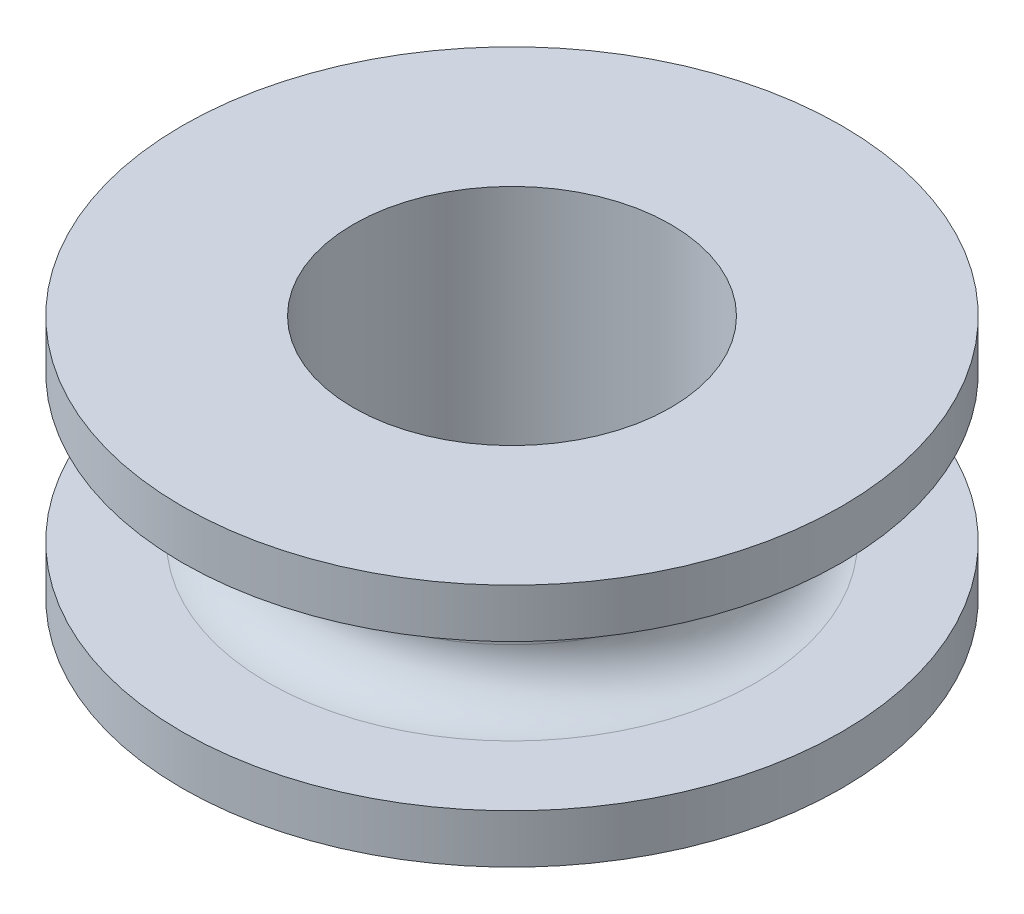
ISO-10303-21;
HEADER;
FILE_DESCRIPTION(('STEP AP214'),'2;1');
FILE_NAME('part.step','',(''),(''),'','','');
FILE_SCHEMA(('AUTOMOTIVE_DESIGN { 1 0 10303 214 1 1 1 1 }'));
ENDSEC;
DATA;
#1=APPLICATION_CONTEXT('core data for automotive mechanical design processes');
#2=APPLICATION_PROTOCOL_DEFINITION('international standard','automotive_design',2000,#1);
#3=PRODUCT_CONTEXT('',#1,'mechanical');
#4=PRODUCT('Part','Part','',(#3));
#5=PRODUCT_RELATED_PRODUCT_CATEGORY('part','',(#4));
#6=PRODUCT_DEFINITION_FORMATION('','',#4);
#7=PRODUCT_DEFINITION_CONTEXT('part definition',#1,'design');
#8=PRODUCT_DEFINITION('design','',#6,#7);
#9=PRODUCT_DEFINITION_SHAPE('','',#8);
#10=(LENGTH_UNIT() NAMED_UNIT(*) SI_UNIT(.MILLI.,.METRE.));
#11=(NAMED_UNIT(*) PLANE_ANGLE_UNIT() SI_UNIT($,.RADIAN.));
#12=(NAMED_UNIT(*) SI_UNIT($,.STERADIAN.) SOLID_ANGLE_UNIT());
#13=UNCERTAINTY_MEASURE_WITH_UNIT(LENGTH_MEASURE(1.E-05),#10,'distance_accuracy_value','');
#14=(GEOMETRIC_REPRESENTATION_CONTEXT(3) GLOBAL_UNCERTAINTY_ASSIGNED_CONTEXT((#13)) GLOBAL_UNIT_ASSIGNED_CONTEXT((#10,
#11,#12)) REPRESENTATION_CONTEXT('',''));
#15=CARTESIAN_POINT('',(0.,0.,0.));
#16=DIRECTION('',(0.,0.,1.));
#17=DIRECTION('',(1.,0.,0.));
#18=AXIS2_PLACEMENT_3D('',#15,#16,#17);
#19=CARTESIAN_POINT('',(0.,10.,0.));
#20=DIRECTION('',(0.,-1.,0.));
#21=DIRECTION('',(0.,0.,-1.));
#22=AXIS2_PLACEMENT_3D('',#19,#20,#21);
#23=CYLINDRICAL_SURFACE('',#22,8.);
#24=CARTESIAN_POINT('',(0.,6.,0.));
#25=DIRECTION('',(0.,1.,0.));
#26=DIRECTION('',(0.,0.,1.));
#27=AXIS2_PLACEMENT_3D('',#24,#25,#26);
#28=CIRCLE('',#27,8.);
#29=CARTESIAN_POINT('',(0.,6.,8.));
#30=VERTEX_POINT('',#29);
#31=EDGE_CURVE('E40',#30,#30,#28,.F.);
#32=ORIENTED_EDGE('',*,*,#31,.T.);
#33=EDGE_LOOP('',(#32));
#34=FACE_BOUND('',#33,.T.);
#35=CARTESIAN_POINT('',(0.,4.,0.));
#36=DIRECTION('',(0.,-1.,0.));
#37=DIRECTION('',(0.,0.,-1.));
#38=AXIS2_PLACEMENT_3D('',#35,#36,#37);
#39=CIRCLE('',#38,8.);
#40=CARTESIAN_POINT('',(0.,4.,-8.));
#41=VERTEX_POINT('',#40);
#42=EDGE_CURVE('E44',#41,#41,#39,.F.);
#43=ORIENTED_EDGE('',*,*,#42,.T.);
#44=EDGE_LOOP('',(#43));
#45=FACE_BOUND('',#44,.T.);
#46=ADVANCED_FACE('F33',(#34,#45),#23,.T.);
#47=CARTESIAN_POINT('',(0.,10.,0.));
#48=DIRECTION('',(0.,1.,0.));
#49=DIRECTION('',(0.,0.,1.));
#50=AXIS2_PLACEMENT_3D('',#47,#48,#49);
#51=PLANE('',#50);
#52=CARTESIAN_POINT('',(0.,10.,0.));
#53=DIRECTION('',(0.,1.,0.));
#54=DIRECTION('',(0.,0.,1.));
#55=AXIS2_PLACEMENT_3D('',#52,#53,#54);
#56=CIRCLE('',#55,6.5);
#57=CARTESIAN_POINT('',(0.,10.,6.5));
#58=VERTEX_POINT('',#57);
#59=EDGE_CURVE('E53',#58,#58,#56,.T.);
#60=ORIENTED_EDGE('',*,*,#59,.F.);
#61=EDGE_LOOP('',(#60));
#62=FACE_BOUND('',#61,.T.);
#63=CARTESIAN_POINT('',(0.,10.,0.));
#64=DIRECTION('',(0.,1.,0.));
#65=DIRECTION('',(0.,0.,1.));
#66=AXIS2_PLACEMENT_3D('',#63,#64,#65);
#67=CIRCLE('',#66,13.5);
#68=CARTESIAN_POINT('',(0.,10.,13.5));
#69=VERTEX_POINT('',#68);
#70=EDGE_CURVE('E68',#69,#69,#67,.T.);
#71=ORIENTED_EDGE('',*,*,#70,.T.);
#72=EDGE_LOOP('',(#71));
#73=FACE_BOUND('',#72,.T.);
#74=ADVANCED_FACE('F72',(#62,#73),#51,.T.);
#75=CARTESIAN_POINT('',(0.,0.,0.));
#76=DIRECTION('',(0.,1.,0.));
#77=DIRECTION('',(0.,0.,1.));
#78=AXIS2_PLACEMENT_3D('',#75,#76,#77);
#79=PLANE('',#78);
#80=CARTESIAN_POINT('',(0.,0.,0.));
#81=DIRECTION('',(0.,1.,0.));
#82=DIRECTION('',(0.,0.,1.));
#83=AXIS2_PLACEMENT_3D('',#80,#81,#82);
#84=CIRCLE('',#83,6.5);
#85=CARTESIAN_POINT('',(0.,0.,6.5));
#86=VERTEX_POINT('',#85);
#87=EDGE_CURVE('E54',#86,#86,#84,.T.);
#88=ORIENTED_EDGE('',*,*,#87,.T.);
#89=EDGE_LOOP('',(#88));
#90=FACE_BOUND('',#89,.T.);
#91=CARTESIAN_POINT('',(0.,0.,0.));
#92=DIRECTION('',(0.,1.,0.));
#93=DIRECTION('',(0.,0.,1.));
#94=AXIS2_PLACEMENT_3D('',#91,#92,#93);
#95=CIRCLE('',#94,13.5);
#96=CARTESIAN_POINT('',(0.,0.,13.5));
#97=VERTEX_POINT('',#96);
#98=EDGE_CURVE('E62',#97,#97,#95,.T.);
#99=ORIENTED_EDGE('',*,*,#98,.F.);
#100=EDGE_LOOP('',(#99));
#101=FACE_BOUND('',#100,.T.);
#102=ADVANCED_FACE('F97',(#90,#101),#79,.F.);
#103=CARTESIAN_POINT('',(0.,10.,0.));
#104=DIRECTION('',(0.,-1.,0.));
#105=DIRECTION('',(0.,0.,-1.));
#106=AXIS2_PLACEMENT_3D('',#103,#104,#105);
#107=CYLINDRICAL_SURFACE('',#106,6.5);
#108=ORIENTED_EDGE('',*,*,#59,.T.);
#109=EDGE_LOOP('',(#108));
#110=FACE_BOUND('',#109,.T.);
#111=ORIENTED_EDGE('',*,*,#87,.F.);
#112=EDGE_LOOP('',(#111));
#113=FACE_BOUND('',#112,.T.);
#114=ADVANCED_FACE('F132',(#110,#113),#107,.F.);
#115=CARTESIAN_POINT('',(8.,2.,0.));
#116=DIRECTION('',(0.,-1.,0.));
#117=DIRECTION('',(0.,0.,-1.));
#118=AXIS2_PLACEMENT_3D('',#115,#116,#117);
#119=PLANE('',#118);
#120=CARTESIAN_POINT('',(0.,2.,0.));
#121=DIRECTION('',(0.,-1.,0.));
#122=DIRECTION('',(0.,0.,-1.));
#123=AXIS2_PLACEMENT_3D('',#120,#121,#122);
#124=CIRCLE('',#123,10.);
#125=CARTESIAN_POINT('',(0.,2.,-10.));
#126=VERTEX_POINT('',#125);
#127=EDGE_CURVE('E10',#126,#126,#124,.T.);
#128=ORIENTED_EDGE('',*,*,#127,.T.);
#129=EDGE_LOOP('',(#128));
#130=FACE_BOUND('',#129,.T.);
#131=CARTESIAN_POINT('',(0.,2.,0.));
#132=DIRECTION('',(0.,1.,0.));
#133=DIRECTION('',(0.,0.,1.));
#134=AXIS2_PLACEMENT_3D('',#131,#132,#133);
#135=CIRCLE('',#134,13.5);
#136=CARTESIAN_POINT('',(0.,2.,13.5));
#137=VERTEX_POINT('',#136);
#138=EDGE_CURVE('E57',#137,#137,#135,.T.);
#139=ORIENTED_EDGE('',*,*,#138,.T.);
#140=EDGE_LOOP('',(#139));
#141=FACE_BOUND('',#140,.T.);
#142=ADVANCED_FACE('F89',(#130,#141),#119,.F.);
#143=CARTESIAN_POINT('',(0.,10.,0.));
#144=DIRECTION('',(0.,1.,0.));
#145=DIRECTION('',(0.,0.,1.));
#146=AXIS2_PLACEMENT_3D('',#143,#144,#145);
#147=CYLINDRICAL_SURFACE('',#146,13.5);
#148=ORIENTED_EDGE('',*,*,#138,.F.);
#149=EDGE_LOOP('',(#148));
#150=FACE_BOUND('',#149,.T.);
#151=ORIENTED_EDGE('',*,*,#98,.T.);
#152=EDGE_LOOP('',(#151));
#153=FACE_BOUND('',#152,.T.);
#154=ADVANCED_FACE('F83',(#150,#153),#147,.T.);
#155=CARTESIAN_POINT('',(8.,8.,0.));
#156=DIRECTION('',(0.,1.,0.));
#157=DIRECTION('',(0.,0.,1.));
#158=AXIS2_PLACEMENT_3D('',#155,#156,#157);
#159=PLANE('',#158);
#160=CARTESIAN_POINT('',(0.,8.,0.));
#161=DIRECTION('',(0.,1.,0.));
#162=DIRECTION('',(0.,0.,1.));
#163=AXIS2_PLACEMENT_3D('',#160,#161,#162);
#164=CIRCLE('',#163,10.);
#165=CARTESIAN_POINT('',(0.,8.,10.));
#166=VERTEX_POINT('',#165);
#167=EDGE_CURVE('E48',#166,#166,#164,.T.);
#168=ORIENTED_EDGE('',*,*,#167,.T.);
#169=EDGE_LOOP('',(#168));
#170=FACE_BOUND('',#169,.T.);
#171=CARTESIAN_POINT('',(0.,8.,0.));
#172=DIRECTION('',(0.,1.,0.));
#173=DIRECTION('',(0.,0.,1.));
#174=AXIS2_PLACEMENT_3D('',#171,#172,#173);
#175=CIRCLE('',#174,13.5);
#176=CARTESIAN_POINT('',(0.,8.,13.5));
#177=VERTEX_POINT('',#176);
#178=EDGE_CURVE('E65',#177,#177,#175,.T.);
#179=ORIENTED_EDGE('',*,*,#178,.F.);
#180=EDGE_LOOP('',(#179));
#181=FACE_BOUND('',#180,.T.);
#182=ADVANCED_FACE('F78',(#170,#181),#159,.F.);
#183=CARTESIAN_POINT('',(0.,10.,0.));
#184=DIRECTION('',(0.,1.,0.));
#185=DIRECTION('',(0.,0.,1.));
#186=AXIS2_PLACEMENT_3D('',#183,#184,#185);
#187=CYLINDRICAL_SURFACE('',#186,13.5);
#188=ORIENTED_EDGE('',*,*,#70,.F.);
#189=EDGE_LOOP('',(#188));
#190=FACE_BOUND('',#189,.T.);
#191=ORIENTED_EDGE('',*,*,#178,.T.);
#192=EDGE_LOOP('',(#191));
#193=FACE_BOUND('',#192,.T.);
#194=ADVANCED_FACE('F74',(#190,#193),#187,.T.);
#195=CARTESIAN_POINT('',(0.,6.,0.));
#196=DIRECTION('',(0.,1.,0.));
#197=DIRECTION('',(0.,0.,1.));
#198=AXIS2_PLACEMENT_3D('',#195,#196,#197);
#199=TOROIDAL_SURFACE('',#198,10.,2.);
#200=ORIENTED_EDGE('',*,*,#31,.F.);
#201=EDGE_LOOP('',(#200));
#202=FACE_BOUND('',#201,.T.);
#203=ORIENTED_EDGE('',*,*,#167,.F.);
#204=EDGE_LOOP('',(#203));
#205=FACE_BOUND('',#204,.T.);
#206=ADVANCED_FACE('F77',(#202,#205),#199,.F.);
#207=CARTESIAN_POINT('',(0.,4.,0.));
#208=DIRECTION('',(0.,-1.,0.));
#209=DIRECTION('',(0.,0.,-1.));
#210=AXIS2_PLACEMENT_3D('',#207,#208,#209);
#211=TOROIDAL_SURFACE('',#210,10.,2.);
#212=ORIENTED_EDGE('',*,*,#42,.F.);
#213=EDGE_LOOP('',(#212));
#214=FACE_BOUND('',#213,.T.);
#215=ORIENTED_EDGE('',*,*,#127,.F.);
#216=EDGE_LOOP('',(#215));
#217=FACE_BOUND('',#216,.T.);
#218=ADVANCED_FACE('F35',(#214,#217),#211,.F.);
#219=CLOSED_SHELL('',(#46,#74,#102,#114,#142,#154,#182,#194,#206,#218));
#220=MANIFOLD_SOLID_BREP('B2',#219);
#221=ADVANCED_BREP_SHAPE_REPRESENTATION('',(#18,#220),#14);
#222=SHAPE_DEFINITION_REPRESENTATION(#9,#221);
ENDSEC;
END-ISO-10303-21;
